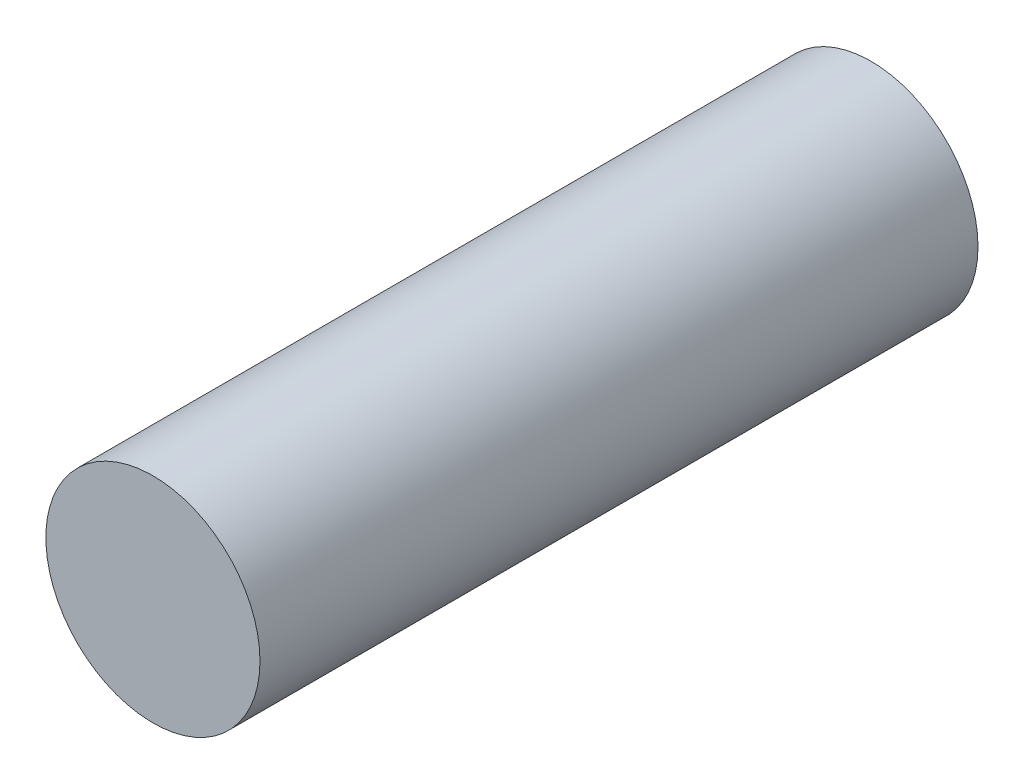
ISO-10303-21;
HEADER;
FILE_DESCRIPTION(('STEP AP214'),'2;1');
FILE_NAME('part.step','',(''),(''),'','','');
FILE_SCHEMA(('AUTOMOTIVE_DESIGN { 1 0 10303 214 1 1 1 1 }'));
ENDSEC;
DATA;
#1=APPLICATION_CONTEXT('core data for automotive mechanical design processes');
#2=APPLICATION_PROTOCOL_DEFINITION('international standard','automotive_design',2000,#1);
#3=PRODUCT_CONTEXT('',#1,'mechanical');
#4=PRODUCT('Part','Part','',(#3));
#5=PRODUCT_RELATED_PRODUCT_CATEGORY('part','',(#4));
#6=PRODUCT_DEFINITION_FORMATION('','',#4);
#7=PRODUCT_DEFINITION_CONTEXT('part definition',#1,'design');
#8=PRODUCT_DEFINITION('design','',#6,#7);
#9=PRODUCT_DEFINITION_SHAPE('','',#8);
#10=(LENGTH_UNIT() NAMED_UNIT(*) SI_UNIT(.MILLI.,.METRE.));
#11=(NAMED_UNIT(*) PLANE_ANGLE_UNIT() SI_UNIT($,.RADIAN.));
#12=(NAMED_UNIT(*) SI_UNIT($,.STERADIAN.) SOLID_ANGLE_UNIT());
#13=UNCERTAINTY_MEASURE_WITH_UNIT(LENGTH_MEASURE(1.E-05),#10,'distance_accuracy_value','');
#14=(GEOMETRIC_REPRESENTATION_CONTEXT(3) GLOBAL_UNCERTAINTY_ASSIGNED_CONTEXT((#13)) GLOBAL_UNIT_ASSIGNED_CONTEXT((#10,
#11,#12)) REPRESENTATION_CONTEXT('',''));
#15=CARTESIAN_POINT('',(0.,0.,0.));
#16=DIRECTION('',(0.,0.,1.));
#17=DIRECTION('',(1.,0.,0.));
#18=AXIS2_PLACEMENT_3D('',#15,#16,#17);
#19=CARTESIAN_POINT('',(0.,0.,4.3434));
#20=DIRECTION('',(0.,0.,-1.));
#21=DIRECTION('',(-1.,0.,0.));
#22=AXIS2_PLACEMENT_3D('',#19,#20,#21);
#23=CYLINDRICAL_SURFACE('',#22,0.6477);
#24=CARTESIAN_POINT('',(0.,0.,4.3434));
#25=DIRECTION('',(0.,0.,1.));
#26=DIRECTION('',(1.,0.,0.));
#27=AXIS2_PLACEMENT_3D('',#24,#25,#26);
#28=CIRCLE('',#27,0.6477);
#29=CARTESIAN_POINT('',(0.6477,0.,4.3434));
#30=VERTEX_POINT('',#29);
#31=EDGE_CURVE('E10',#30,#30,#28,.T.);
#32=ORIENTED_EDGE('',*,*,#31,.F.);
#33=EDGE_LOOP('',(#32));
#34=FACE_BOUND('',#33,.T.);
#35=CARTESIAN_POINT('',(0.,0.,0.));
#36=DIRECTION('',(0.,0.,1.));
#37=DIRECTION('',(1.,0.,0.));
#38=AXIS2_PLACEMENT_3D('',#35,#36,#37);
#39=CIRCLE('',#38,0.6477);
#40=CARTESIAN_POINT('',(0.6477,0.,0.));
#41=VERTEX_POINT('',#40);
#42=EDGE_CURVE('E33',#41,#41,#39,.T.);
#43=ORIENTED_EDGE('',*,*,#42,.T.);
#44=EDGE_LOOP('',(#43));
#45=FACE_BOUND('',#44,.T.);
#46=ADVANCED_FACE('F30',(#34,#45),#23,.T.);
#47=CARTESIAN_POINT('',(0.,0.,4.3434));
#48=DIRECTION('',(0.,0.,1.));
#49=DIRECTION('',(1.,0.,0.));
#50=AXIS2_PLACEMENT_3D('',#47,#48,#49);
#51=PLANE('',#50);
#52=ORIENTED_EDGE('',*,*,#31,.T.);
#53=EDGE_LOOP('',(#52));
#54=FACE_BOUND('',#53,.T.);
#55=ADVANCED_FACE('F45',(#54),#51,.T.);
#56=CARTESIAN_POINT('',(0.,0.,0.));
#57=DIRECTION('',(0.,0.,1.));
#58=DIRECTION('',(1.,0.,0.));
#59=AXIS2_PLACEMENT_3D('',#56,#57,#58);
#60=PLANE('',#59);
#61=ORIENTED_EDGE('',*,*,#42,.F.);
#62=EDGE_LOOP('',(#61));
#63=FACE_BOUND('',#62,.T.);
#64=ADVANCED_FACE('F43',(#63),#60,.F.);
#65=CLOSED_SHELL('',(#46,#55,#64));
#66=MANIFOLD_SOLID_BREP('B2',#65);
#67=ADVANCED_BREP_SHAPE_REPRESENTATION('',(#18,#66),#14);
#68=SHAPE_DEFINITION_REPRESENTATION(#9,#67);
ENDSEC;
END-ISO-10303-21;
